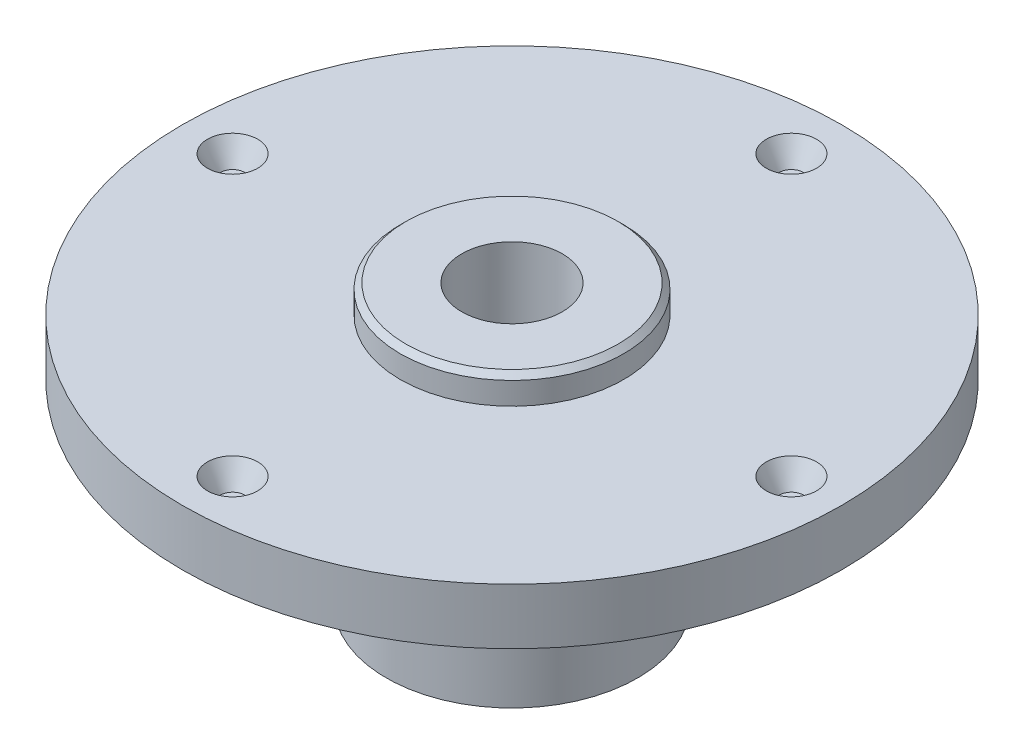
ISO-10303-21;
HEADER;
FILE_DESCRIPTION(('STEP AP214'),'2;1');
FILE_NAME('part.step','',(''),(''),'','','');
FILE_SCHEMA(('AUTOMOTIVE_DESIGN { 1 0 10303 214 1 1 1 1 }'));
ENDSEC;
DATA;
#1=APPLICATION_CONTEXT('core data for automotive mechanical design processes');
#2=APPLICATION_PROTOCOL_DEFINITION('international standard','automotive_design',2000,#1);
#3=PRODUCT_CONTEXT('',#1,'mechanical');
#4=PRODUCT('Part','Part','',(#3));
#5=PRODUCT_RELATED_PRODUCT_CATEGORY('part','',(#4));
#6=PRODUCT_DEFINITION_FORMATION('','',#4);
#7=PRODUCT_DEFINITION_CONTEXT('part definition',#1,'design');
#8=PRODUCT_DEFINITION('design','',#6,#7);
#9=PRODUCT_DEFINITION_SHAPE('','',#8);
#10=(LENGTH_UNIT() NAMED_UNIT(*) SI_UNIT(.MILLI.,.METRE.));
#11=(NAMED_UNIT(*) PLANE_ANGLE_UNIT() SI_UNIT($,.RADIAN.));
#12=(NAMED_UNIT(*) SI_UNIT($,.STERADIAN.) SOLID_ANGLE_UNIT());
#13=UNCERTAINTY_MEASURE_WITH_UNIT(LENGTH_MEASURE(1.E-05),#10,'distance_accuracy_value','');
#14=(GEOMETRIC_REPRESENTATION_CONTEXT(3) GLOBAL_UNCERTAINTY_ASSIGNED_CONTEXT((#13)) GLOBAL_UNIT_ASSIGNED_CONTEXT((#10,
#11,#12)) REPRESENTATION_CONTEXT('',''));
#15=CARTESIAN_POINT('',(0.,0.,0.));
#16=DIRECTION('',(0.,0.,1.));
#17=DIRECTION('',(1.,0.,0.));
#18=AXIS2_PLACEMENT_3D('',#15,#16,#17);
#19=CARTESIAN_POINT('',(0.,0.,0.));
#20=DIRECTION('',(0.,-1.,0.));
#21=DIRECTION('',(0.,0.,-1.));
#22=AXIS2_PLACEMENT_3D('',#19,#20,#21);
#23=CYLINDRICAL_SURFACE('',#22,9.);
#24=CARTESIAN_POINT('',(-8.64580823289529,15.,-2.5));
#25=CARTESIAN_POINT('',(-8.64581037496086,15.1374869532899,-2.49999714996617));
#26=CARTESIAN_POINT('',(-8.64912360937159,15.2750032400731,-2.48861977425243));
#27=CARTESIAN_POINT('',(-8.66197474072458,15.5460485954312,-2.44350693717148));
#28=CARTESIAN_POINT('',(-8.67151541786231,15.6795758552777,-2.40976148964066));
#29=CARTESIAN_POINT('',(-8.69565935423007,15.9386823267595,-2.32112008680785));
#30=CARTESIAN_POINT('',(-8.71025507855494,16.0642730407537,-2.26625559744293));
#31=CARTESIAN_POINT('',(-8.74285475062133,16.3044909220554,-2.13703377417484));
#32=CARTESIAN_POINT('',(-8.76085904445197,16.4191169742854,-2.06267446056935));
#33=CARTESIAN_POINT('',(-8.79879482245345,16.6372618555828,-1.89441531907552));
#34=CARTESIAN_POINT('',(-8.81876275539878,16.7404391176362,-1.80008077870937));
#35=CARTESIAN_POINT('',(-8.85806239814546,16.9297308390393,-1.59548286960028));
#36=CARTESIAN_POINT('',(-8.87739403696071,17.015843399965,-1.48521773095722));
#37=CARTESIAN_POINT('',(-8.91365202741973,17.1700044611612,-1.249500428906));
#38=CARTESIAN_POINT('',(-8.93053038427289,17.2377105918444,-1.12381632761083));
#39=CARTESIAN_POINT('',(-8.95956018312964,17.3508992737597,-0.862300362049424));
#40=CARTESIAN_POINT('',(-8.97171249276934,17.396385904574,-0.726470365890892));
#41=CARTESIAN_POINT('',(-8.98966318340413,17.4627309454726,-0.452086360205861));
#42=CARTESIAN_POINT('',(-8.99561138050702,17.4841710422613,-0.313682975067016));
#43=CARTESIAN_POINT('',(-9.00100867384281,17.503647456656,-0.0351244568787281));
#44=CARTESIAN_POINT('',(-9.00045894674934,17.5016880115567,0.105030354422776));
#45=CARTESIAN_POINT('',(-8.99303086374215,17.4748244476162,0.379054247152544));
#46=CARTESIAN_POINT('',(-8.9863259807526,17.4505492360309,0.512990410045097));
#47=CARTESIAN_POINT('',(-8.96754760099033,17.3807628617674,0.77480748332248));
#48=CARTESIAN_POINT('',(-8.95547378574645,17.3352504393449,0.902688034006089));
#49=CARTESIAN_POINT('',(-8.92706250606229,17.2238179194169,1.15033359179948));
#50=CARTESIAN_POINT('',(-8.91068150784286,17.1576880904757,1.26999902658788));
#51=CARTESIAN_POINT('',(-8.87541221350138,17.0070603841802,1.49674457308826));
#52=CARTESIAN_POINT('',(-8.85652339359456,16.922558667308,1.60382204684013));
#53=CARTESIAN_POINT('',(-8.81753663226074,16.7342713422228,1.8061067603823));
#54=CARTESIAN_POINT('',(-8.79741936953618,16.6299381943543,1.9008012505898));
#55=CARTESIAN_POINT('',(-8.75880383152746,16.4066673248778,2.07148108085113));
#56=CARTESIAN_POINT('',(-8.74030567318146,16.2877285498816,2.14746507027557));
#57=CARTESIAN_POINT('',(-8.70694013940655,16.0374352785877,2.27900238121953));
#58=CARTESIAN_POINT('',(-8.69209980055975,15.9059977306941,2.33440501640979));
#59=CARTESIAN_POINT('',(-8.66806022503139,15.6351564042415,2.42215297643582));
#60=CARTESIAN_POINT('',(-8.65885945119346,15.4957548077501,2.45450458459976));
#61=CARTESIAN_POINT('',(-8.64747148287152,15.2177654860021,2.49432455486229));
#62=CARTESIAN_POINT('',(-8.6450674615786,15.079296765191,2.50256249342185));
#63=CARTESIAN_POINT('',(-8.64694988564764,14.8029580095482,2.49605092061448));
#64=CARTESIAN_POINT('',(-8.65123554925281,14.6650879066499,2.48130409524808));
#65=CARTESIAN_POINT('',(-8.66580389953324,14.3969022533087,2.42992241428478));
#66=CARTESIAN_POINT('',(-8.6759568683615,14.2664883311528,2.39376059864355));
#67=CARTESIAN_POINT('',(-8.70098664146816,14.0135797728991,2.30111259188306));
#68=CARTESIAN_POINT('',(-8.71586410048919,13.8910862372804,2.24462358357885));
#69=CARTESIAN_POINT('',(-8.74910362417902,13.6543046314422,2.11139571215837));
#70=CARTESIAN_POINT('',(-8.767539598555,13.5402782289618,2.03421067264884));
#71=CARTESIAN_POINT('',(-8.80564999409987,13.3265137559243,1.86232721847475));
#72=CARTESIAN_POINT('',(-8.82532466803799,13.2267786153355,1.76762522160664));
#73=CARTESIAN_POINT('',(-8.86445019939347,13.0411785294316,1.55981743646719));
#74=CARTESIAN_POINT('',(-8.88387421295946,12.9558531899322,1.44622359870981));
#75=CARTESIAN_POINT('',(-8.91967402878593,12.8054760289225,1.20588311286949));
#76=CARTESIAN_POINT('',(-8.93604999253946,12.7404231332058,1.07913716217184));
#77=CARTESIAN_POINT('',(-8.96380327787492,12.6330504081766,0.816978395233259));
#78=CARTESIAN_POINT('',(-8.97521823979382,12.5905588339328,0.681640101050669));
#79=CARTESIAN_POINT('',(-8.99192942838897,12.5290318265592,0.405376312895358));
#80=CARTESIAN_POINT('',(-8.99722713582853,12.5099907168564,0.264452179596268));
#81=CARTESIAN_POINT('',(-9.00103042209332,12.4962856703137,-0.0139601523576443));
#82=CARTESIAN_POINT('',(-8.99975568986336,12.5008332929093,-0.151407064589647));
#83=CARTESIAN_POINT('',(-8.99106088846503,12.5323285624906,-0.423500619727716));
#84=CARTESIAN_POINT('',(-8.98364108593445,12.55927523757,-0.55814738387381));
#85=CARTESIAN_POINT('',(-8.96353984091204,12.6343432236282,-0.819784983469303));
#86=CARTESIAN_POINT('',(-8.95090116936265,12.6822925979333,-0.946828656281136));
#87=CARTESIAN_POINT('',(-8.9216782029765,12.7978519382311,-1.19113920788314));
#88=CARTESIAN_POINT('',(-8.90509332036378,12.8654648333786,-1.30840462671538));
#89=CARTESIAN_POINT('',(-8.86915397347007,13.0206719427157,-1.53345112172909));
#90=CARTESIAN_POINT('',(-8.84973411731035,13.1087800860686,-1.64086726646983));
#91=CARTESIAN_POINT('',(-8.81055920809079,13.3015179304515,-1.83965563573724));
#92=CARTESIAN_POINT('',(-8.79080406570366,13.4061520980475,-1.931023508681));
#93=CARTESIAN_POINT('',(-8.75263553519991,13.6320445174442,-2.09734241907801));
#94=CARTESIAN_POINT('',(-8.73426670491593,13.7536463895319,-2.17183796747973));
#95=CARTESIAN_POINT('',(-8.70160385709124,14.0081439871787,-2.29922652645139));
#96=CARTESIAN_POINT('',(-8.68730739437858,14.1410328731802,-2.35213250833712));
#97=CARTESIAN_POINT('',(-8.66621345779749,14.3943601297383,-2.42859494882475));
#98=CARTESIAN_POINT('',(-8.65862660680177,14.5137894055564,-2.45530563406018));
#99=CARTESIAN_POINT('',(-8.64842338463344,14.7554716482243,-2.49100820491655));
#100=CARTESIAN_POINT('',(-8.64580632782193,14.8777242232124,-2.50000253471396));
#101=CARTESIAN_POINT('',(-8.64580823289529,15.,-2.5));
#102=B_SPLINE_CURVE_WITH_KNOTS('',3,(#24,#25,#26,#27,#28,#29,#30,#31,#32,#33,#34,#35,#36,#37,
#38,#39,#40,#41,#42,#43,#44,#45,#46,#47,#48,#49,#50,#51,#52,#53,#54,#55,#56,#57,#58,#59,#60,#61,
#62,#63,#64,#65,#66,#67,#68,#69,#70,#71,#72,#73,#74,#75,#76,#77,#78,#79,#80,#81,#82,#83,#84,#85,
#86,#87,#88,#89,#90,#91,#92,#93,#94,#95,#96,#97,#98,#99,#100,#101),.UNSPECIFIED.,.T.,.F.,(4,2,2,
2,2,2,2,2,2,2,2,2,2,2,2,2,2,2,2,2,2,2,2,2,2,2,2,2,2,2,2,2,2,2,2,2,2,2,4),(0.,0.412010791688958,
0.824205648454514,1.23578872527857,1.64741361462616,2.0691389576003,2.49091119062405,
2.92006196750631,3.34913392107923,3.7675863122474,4.18596292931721,4.59289867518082,
4.99985856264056,5.4111013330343,5.82243013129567,6.24742875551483,6.67245804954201,
7.10054057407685,7.5285063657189,7.94265637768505,8.35675799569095,8.76203677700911,
9.16737174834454,9.58226667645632,9.99724654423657,10.4253750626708,10.8534808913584,
11.2782793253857,11.7029749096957,12.1135686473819,12.5241445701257,12.9314203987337,
13.3387569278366,13.7576868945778,14.1767302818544,14.6060087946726,15.0350290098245,
15.4015066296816,15.7679336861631),.UNSPECIFIED.);
#103=CARTESIAN_POINT('',(-8.64580823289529,15.,-2.5));
#104=VERTEX_POINT('',#103);
#105=EDGE_CURVE('E86',#104,#104,#102,.T.);
#106=ORIENTED_EDGE('',*,*,#105,.F.);
#107=EDGE_LOOP('',(#106));
#108=FACE_BOUND('',#107,.T.);
#109=CARTESIAN_POINT('',(8.64580823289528,15.,-2.5));
#110=CARTESIAN_POINT('',(8.64581037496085,14.8625130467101,-2.49999714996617));
#111=CARTESIAN_POINT('',(8.64912360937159,14.7249967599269,-2.48861977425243));
#112=CARTESIAN_POINT('',(8.66197474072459,14.4539514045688,-2.44350693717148));
#113=CARTESIAN_POINT('',(8.67151541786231,14.3204241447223,-2.40976148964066));
#114=CARTESIAN_POINT('',(8.69565935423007,14.0613176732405,-2.32112008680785));
#115=CARTESIAN_POINT('',(8.71025507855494,13.9357269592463,-2.26625559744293));
#116=CARTESIAN_POINT('',(8.74285475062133,13.6955090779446,-2.13703377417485));
#117=CARTESIAN_POINT('',(8.76085904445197,13.5808830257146,-2.06267446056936));
#118=CARTESIAN_POINT('',(8.79879482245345,13.3627381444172,-1.89441531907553));
#119=CARTESIAN_POINT('',(8.81876275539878,13.2595608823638,-1.80008077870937));
#120=CARTESIAN_POINT('',(8.85806239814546,13.0702691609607,-1.59548286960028));
#121=CARTESIAN_POINT('',(8.87739403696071,12.984156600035,-1.48521773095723));
#122=CARTESIAN_POINT('',(8.91365202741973,12.8299955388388,-1.249500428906));
#123=CARTESIAN_POINT('',(8.93053038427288,12.7622894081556,-1.12381632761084));
#124=CARTESIAN_POINT('',(8.95956018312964,12.6491007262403,-0.862300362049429));
#125=CARTESIAN_POINT('',(8.97171249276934,12.603614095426,-0.726470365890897));
#126=CARTESIAN_POINT('',(8.98966318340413,12.5372690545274,-0.452086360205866));
#127=CARTESIAN_POINT('',(8.99561138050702,12.5158289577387,-0.31368297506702));
#128=CARTESIAN_POINT('',(9.00100867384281,12.496352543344,-0.0351244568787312));
#129=CARTESIAN_POINT('',(9.00045894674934,12.4983119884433,0.105030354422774));
#130=CARTESIAN_POINT('',(8.99303086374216,12.5251755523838,0.379054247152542));
#131=CARTESIAN_POINT('',(8.9863259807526,12.5494507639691,0.512990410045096));
#132=CARTESIAN_POINT('',(8.96754760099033,12.6192371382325,0.774807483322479));
#133=CARTESIAN_POINT('',(8.95547378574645,12.6647495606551,0.902688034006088));
#134=CARTESIAN_POINT('',(8.92706250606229,12.7761820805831,1.15033359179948));
#135=CARTESIAN_POINT('',(8.91068150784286,12.8423119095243,1.26999902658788));
#136=CARTESIAN_POINT('',(8.87541221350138,12.9929396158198,1.49674457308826));
#137=CARTESIAN_POINT('',(8.85652339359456,13.077441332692,1.60382204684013));
#138=CARTESIAN_POINT('',(8.81753663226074,13.2657286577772,1.8061067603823));
#139=CARTESIAN_POINT('',(8.79741936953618,13.3700618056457,1.9008012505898));
#140=CARTESIAN_POINT('',(8.75880383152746,13.5933326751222,2.07148108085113));
#141=CARTESIAN_POINT('',(8.74030567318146,13.7122714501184,2.14746507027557));
#142=CARTESIAN_POINT('',(8.70694013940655,13.9625647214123,2.27900238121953));
#143=CARTESIAN_POINT('',(8.69209980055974,14.0940022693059,2.33440501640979));
#144=CARTESIAN_POINT('',(8.66806022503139,14.3648435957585,2.42215297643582));
#145=CARTESIAN_POINT('',(8.65885945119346,14.5042451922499,2.45450458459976));
#146=CARTESIAN_POINT('',(8.64747148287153,14.7822345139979,2.49432455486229));
#147=CARTESIAN_POINT('',(8.6450674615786,14.920703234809,2.50256249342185));
#148=CARTESIAN_POINT('',(8.64694988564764,15.1970419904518,2.49605092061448));
#149=CARTESIAN_POINT('',(8.65123554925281,15.3349120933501,2.48130409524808));
#150=CARTESIAN_POINT('',(8.66580389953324,15.6030977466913,2.42992241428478));
#151=CARTESIAN_POINT('',(8.6759568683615,15.7335116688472,2.39376059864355));
#152=CARTESIAN_POINT('',(8.70098664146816,15.9864202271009,2.30111259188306));
#153=CARTESIAN_POINT('',(8.71586410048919,16.1089137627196,2.24462358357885));
#154=CARTESIAN_POINT('',(8.74910362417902,16.3456953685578,2.11139571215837));
#155=CARTESIAN_POINT('',(8.76753959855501,16.4597217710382,2.03421067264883));
#156=CARTESIAN_POINT('',(8.80564999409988,16.6734862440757,1.86232721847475));
#157=CARTESIAN_POINT('',(8.82532466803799,16.7732213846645,1.76762522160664));
#158=CARTESIAN_POINT('',(8.86445019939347,16.9588214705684,1.5598174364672));
#159=CARTESIAN_POINT('',(8.88387421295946,17.0441468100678,1.44622359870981));
#160=CARTESIAN_POINT('',(8.91967402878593,17.1945239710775,1.20588311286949));
#161=CARTESIAN_POINT('',(8.93604999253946,17.2595768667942,1.07913716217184));
#162=CARTESIAN_POINT('',(8.96380327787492,17.3669495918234,0.816978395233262));
#163=CARTESIAN_POINT('',(8.97521823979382,17.4094411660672,0.681640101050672));
#164=CARTESIAN_POINT('',(8.99192942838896,17.4709681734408,0.405376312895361));
#165=CARTESIAN_POINT('',(8.99722713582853,17.4900092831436,0.26445217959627));
#166=CARTESIAN_POINT('',(9.00103042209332,17.5037143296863,-0.0139601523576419));
#167=CARTESIAN_POINT('',(8.99975568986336,17.4991667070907,-0.151407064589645));
#168=CARTESIAN_POINT('',(8.99106088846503,17.4676714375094,-0.423500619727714));
#169=CARTESIAN_POINT('',(8.98364108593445,17.44072476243,-0.558147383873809));
#170=CARTESIAN_POINT('',(8.96353984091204,17.3656567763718,-0.819784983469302));
#171=CARTESIAN_POINT('',(8.95090116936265,17.3177074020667,-0.946828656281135));
#172=CARTESIAN_POINT('',(8.9216782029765,17.2021480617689,-1.19113920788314));
#173=CARTESIAN_POINT('',(8.90509332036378,17.1345351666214,-1.30840462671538));
#174=CARTESIAN_POINT('',(8.86915397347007,16.9793280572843,-1.53345112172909));
#175=CARTESIAN_POINT('',(8.84973411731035,16.8912199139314,-1.64086726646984));
#176=CARTESIAN_POINT('',(8.81055920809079,16.6984820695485,-1.83965563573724));
#177=CARTESIAN_POINT('',(8.79080406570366,16.5938479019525,-1.931023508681));
#178=CARTESIAN_POINT('',(8.75263553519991,16.3679554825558,-2.09734241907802));
#179=CARTESIAN_POINT('',(8.73426670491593,16.2463536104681,-2.17183796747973));
#180=CARTESIAN_POINT('',(8.70160385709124,15.9918560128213,-2.29922652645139));
#181=CARTESIAN_POINT('',(8.68730739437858,15.8589671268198,-2.35213250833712));
#182=CARTESIAN_POINT('',(8.66621345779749,15.6056398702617,-2.42859494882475));
#183=CARTESIAN_POINT('',(8.65862660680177,15.4862105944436,-2.45530563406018));
#184=CARTESIAN_POINT('',(8.64842338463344,15.2445283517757,-2.49100820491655));
#185=CARTESIAN_POINT('',(8.64580632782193,15.1222757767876,-2.50000253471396));
#186=CARTESIAN_POINT('',(8.64580823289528,15.,-2.5));
#187=B_SPLINE_CURVE_WITH_KNOTS('',3,(#109,#110,#111,#112,#113,#114,#115,#116,#117,#118,#119,
#120,#121,#122,#123,#124,#125,#126,#127,#128,#129,#130,#131,#132,#133,#134,#135,#136,#137,#138,
#139,#140,#141,#142,#143,#144,#145,#146,#147,#148,#149,#150,#151,#152,#153,#154,#155,#156,#157,
#158,#159,#160,#161,#162,#163,#164,#165,#166,#167,#168,#169,#170,#171,#172,#173,#174,#175,#176,
#177,#178,#179,#180,#181,#182,#183,#184,#185,#186),.UNSPECIFIED.,.T.,.F.,(4,2,2,2,2,2,2,2,2,2,2,
2,2,2,2,2,2,2,2,2,2,2,2,2,2,2,2,2,2,2,2,2,2,2,2,2,2,2,4),(0.,0.412010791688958,
0.824205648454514,1.23578872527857,1.64741361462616,2.0691389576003,2.49091119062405,
2.9200619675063,3.34913392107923,3.7675863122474,4.18596292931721,4.59289867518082,
4.99985856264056,5.41110133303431,5.82243013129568,6.24742875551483,6.67245804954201,
7.10054057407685,7.52850636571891,7.94265637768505,8.35675799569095,8.76203677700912,
9.16737174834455,9.58226667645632,9.99724654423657,10.4253750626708,10.8534808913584,
11.2782793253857,11.7029749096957,12.1135686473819,12.5241445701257,12.9314203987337,
13.3387569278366,13.7576868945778,14.1767302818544,14.6060087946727,15.0350290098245,
15.4015066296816,15.7679336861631),.UNSPECIFIED.);
#188=CARTESIAN_POINT('',(8.64580823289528,15.,-2.5));
#189=VERTEX_POINT('',#188);
#190=EDGE_CURVE('E81',#189,#189,#187,.T.);
#191=ORIENTED_EDGE('',*,*,#190,.F.);
#192=EDGE_LOOP('',(#191));
#193=FACE_BOUND('',#192,.T.);
#194=CARTESIAN_POINT('',(0.,0.,0.));
#195=DIRECTION('',(0.,-1.,0.));
#196=DIRECTION('',(0.,0.,-1.));
#197=AXIS2_PLACEMENT_3D('',#194,#195,#196);
#198=CIRCLE('',#197,8.99999999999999);
#199=CARTESIAN_POINT('',(0.,0.,-8.99999999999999));
#200=VERTEX_POINT('',#199);
#201=EDGE_CURVE('E116',#200,#200,#198,.T.);
#202=ORIENTED_EDGE('',*,*,#201,.T.);
#203=EDGE_LOOP('',(#202));
#204=FACE_BOUND('',#203,.T.);
#205=CARTESIAN_POINT('',(0.,50.,0.));
#206=DIRECTION('',(0.,-1.,0.));
#207=DIRECTION('',(0.,0.,-1.));
#208=AXIS2_PLACEMENT_3D('',#205,#206,#207);
#209=CIRCLE('',#208,9.);
#210=CARTESIAN_POINT('',(0.,50.,-9.));
#211=VERTEX_POINT('',#210);
#212=EDGE_CURVE('E134',#211,#211,#209,.T.);
#213=ORIENTED_EDGE('',*,*,#212,.F.);
#214=EDGE_LOOP('',(#213));
#215=FACE_BOUND('',#214,.T.);
#216=ADVANCED_FACE('F34',(#108,#193,#204,#215),#23,.F.);
#217=CARTESIAN_POINT('',(20.,50.,0.));
#218=DIRECTION('',(0.,1.,0.));
#219=DIRECTION('',(0.,0.,1.));
#220=AXIS2_PLACEMENT_3D('',#217,#218,#219);
#221=PLANE('',#220);
#222=CARTESIAN_POINT('',(0.,50.,0.));
#223=DIRECTION('',(0.,1.,0.));
#224=DIRECTION('',(0.,0.,1.));
#225=AXIS2_PLACEMENT_3D('',#222,#223,#224);
#226=CIRCLE('',#225,19.);
#227=CARTESIAN_POINT('',(0.,50.,19.));
#228=VERTEX_POINT('',#227);
#229=EDGE_CURVE('E10',#228,#228,#226,.T.);
#230=ORIENTED_EDGE('',*,*,#229,.T.);
#231=EDGE_LOOP('',(#230));
#232=FACE_BOUND('',#231,.T.);
#233=ORIENTED_EDGE('',*,*,#212,.T.);
#234=EDGE_LOOP('',(#233));
#235=FACE_BOUND('',#234,.T.);
#236=ADVANCED_FACE('F158',(#232,#235),#221,.T.);
#237=CARTESIAN_POINT('',(0.,0.,0.));
#238=DIRECTION('',(0.,-1.,0.));
#239=DIRECTION('',(0.,0.,-1.));
#240=AXIS2_PLACEMENT_3D('',#237,#238,#239);
#241=CYLINDRICAL_SURFACE('',#240,20.);
#242=CARTESIAN_POINT('',(0.,49.,0.));
#243=DIRECTION('',(0.,1.,0.));
#244=DIRECTION('',(0.,0.,1.));
#245=AXIS2_PLACEMENT_3D('',#242,#243,#244);
#246=CIRCLE('',#245,20.);
#247=CARTESIAN_POINT('',(0.,49.,20.));
#248=VERTEX_POINT('',#247);
#249=EDGE_CURVE('E41',#248,#248,#246,.F.);
#250=ORIENTED_EDGE('',*,*,#249,.T.);
#251=EDGE_LOOP('',(#250));
#252=FACE_BOUND('',#251,.T.);
#253=CARTESIAN_POINT('',(0.,45.,0.));
#254=DIRECTION('',(0.,-1.,0.));
#255=DIRECTION('',(0.,0.,-1.));
#256=AXIS2_PLACEMENT_3D('',#253,#254,#255);
#257=CIRCLE('',#256,20.);
#258=CARTESIAN_POINT('',(0.,45.,-20.));
#259=VERTEX_POINT('',#258);
#260=EDGE_CURVE('E132',#259,#259,#257,.T.);
#261=ORIENTED_EDGE('',*,*,#260,.F.);
#262=EDGE_LOOP('',(#261));
#263=FACE_BOUND('',#262,.T.);
#264=ADVANCED_FACE('F163',(#252,#263),#241,.T.);
#265=CARTESIAN_POINT('',(59.,45.,0.));
#266=DIRECTION('',(0.,1.,0.));
#267=DIRECTION('',(0.,0.,1.));
#268=AXIS2_PLACEMENT_3D('',#265,#266,#267);
#269=PLANE('',#268);
#270=CARTESIAN_POINT('',(5.23722504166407E-13,45.,50.));
#271=DIRECTION('',(0.,1.,0.));
#272=DIRECTION('',(-1.,0.,0.));
#273=AXIS2_PLACEMENT_3D('',#270,#271,#272);
#274=CIRCLE('',#273,4.5);
#275=CARTESIAN_POINT('',(-4.49999999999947,45.,50.));
#276=VERTEX_POINT('',#275);
#277=EDGE_CURVE('E92',#276,#276,#274,.T.);
#278=ORIENTED_EDGE('',*,*,#277,.F.);
#279=EDGE_LOOP('',(#278));
#280=FACE_BOUND('',#279,.T.);
#281=CARTESIAN_POINT('',(-50.,45.,3.49148336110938E-13));
#282=DIRECTION('',(0.,1.,0.));
#283=DIRECTION('',(0.,0.,-1.));
#284=AXIS2_PLACEMENT_3D('',#281,#282,#283);
#285=CIRCLE('',#284,4.5);
#286=CARTESIAN_POINT('',(-50.,45.,-4.49999999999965));
#287=VERTEX_POINT('',#286);
#288=EDGE_CURVE('E98',#287,#287,#285,.T.);
#289=ORIENTED_EDGE('',*,*,#288,.F.);
#290=EDGE_LOOP('',(#289));
#291=FACE_BOUND('',#290,.T.);
#292=CARTESIAN_POINT('',(-1.74574168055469E-13,45.,-50.));
#293=DIRECTION('',(0.,1.,0.));
#294=DIRECTION('',(1.,0.,0.));
#295=AXIS2_PLACEMENT_3D('',#292,#293,#294);
#296=CIRCLE('',#295,4.5);
#297=CARTESIAN_POINT('',(4.49999999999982,45.,-50.));
#298=VERTEX_POINT('',#297);
#299=EDGE_CURVE('E104',#298,#298,#296,.T.);
#300=ORIENTED_EDGE('',*,*,#299,.F.);
#301=EDGE_LOOP('',(#300));
#302=FACE_BOUND('',#301,.T.);
#303=CARTESIAN_POINT('',(50.,45.,0.));
#304=DIRECTION('',(0.,1.,0.));
#305=DIRECTION('',(0.,0.,1.));
#306=AXIS2_PLACEMENT_3D('',#303,#304,#305);
#307=CIRCLE('',#306,4.5);
#308=CARTESIAN_POINT('',(50.,45.,4.5));
#309=VERTEX_POINT('',#308);
#310=EDGE_CURVE('E110',#309,#309,#307,.T.);
#311=ORIENTED_EDGE('',*,*,#310,.F.);
#312=EDGE_LOOP('',(#311));
#313=FACE_BOUND('',#312,.T.);
#314=ORIENTED_EDGE('',*,*,#260,.T.);
#315=EDGE_LOOP('',(#314));
#316=FACE_BOUND('',#315,.T.);
#317=CARTESIAN_POINT('',(0.,45.,0.));
#318=DIRECTION('',(0.,-1.,0.));
#319=DIRECTION('',(0.,0.,-1.));
#320=AXIS2_PLACEMENT_3D('',#317,#318,#319);
#321=CIRCLE('',#320,59.);
#322=CARTESIAN_POINT('',(0.,45.,-59.));
#323=VERTEX_POINT('',#322);
#324=EDGE_CURVE('E129',#323,#323,#321,.T.);
#325=ORIENTED_EDGE('',*,*,#324,.F.);
#326=EDGE_LOOP('',(#325));
#327=FACE_BOUND('',#326,.T.);
#328=ADVANCED_FACE('F188',(#280,#291,#302,#313,#316,#327),#269,.T.);
#329=CARTESIAN_POINT('',(0.,0.,0.));
#330=DIRECTION('',(0.,-1.,0.));
#331=DIRECTION('',(0.,0.,-1.));
#332=AXIS2_PLACEMENT_3D('',#329,#330,#331);
#333=CYLINDRICAL_SURFACE('',#332,59.);
#334=ORIENTED_EDGE('',*,*,#324,.T.);
#335=EDGE_LOOP('',(#334));
#336=FACE_BOUND('',#335,.T.);
#337=CARTESIAN_POINT('',(0.,35.,0.));
#338=DIRECTION('',(0.,-1.,0.));
#339=DIRECTION('',(0.,0.,-1.));
#340=AXIS2_PLACEMENT_3D('',#337,#338,#339);
#341=CIRCLE('',#340,59.);
#342=CARTESIAN_POINT('',(0.,35.,-59.));
#343=VERTEX_POINT('',#342);
#344=EDGE_CURVE('E125',#343,#343,#341,.T.);
#345=ORIENTED_EDGE('',*,*,#344,.F.);
#346=EDGE_LOOP('',(#345));
#347=FACE_BOUND('',#346,.T.);
#348=ADVANCED_FACE('F291',(#336,#347),#333,.T.);
#349=CARTESIAN_POINT('',(22.5,35.,0.));
#350=DIRECTION('',(0.,-1.,0.));
#351=DIRECTION('',(0.,0.,-1.));
#352=AXIS2_PLACEMENT_3D('',#349,#350,#351);
#353=PLANE('',#352);
#354=ORIENTED_EDGE('',*,*,#344,.T.);
#355=EDGE_LOOP('',(#354));
#356=FACE_BOUND('',#355,.T.);
#357=CARTESIAN_POINT('',(0.,35.,0.));
#358=DIRECTION('',(0.,-1.,0.));
#359=DIRECTION('',(0.,0.,-1.));
#360=AXIS2_PLACEMENT_3D('',#357,#358,#359);
#361=CIRCLE('',#360,22.5);
#362=CARTESIAN_POINT('',(0.,35.,-22.5));
#363=VERTEX_POINT('',#362);
#364=EDGE_CURVE('E122',#363,#363,#361,.T.);
#365=ORIENTED_EDGE('',*,*,#364,.F.);
#366=EDGE_LOOP('',(#365));
#367=FACE_BOUND('',#366,.T.);
#368=ADVANCED_FACE('F145',(#356,#367),#353,.T.);
#369=CARTESIAN_POINT('',(0.,0.,0.));
#370=DIRECTION('',(0.,-1.,0.));
#371=DIRECTION('',(0.,0.,-1.));
#372=AXIS2_PLACEMENT_3D('',#369,#370,#371);
#373=CYLINDRICAL_SURFACE('',#372,22.5);
#374=CARTESIAN_POINT('',(-22.5,12.5,0.));
#375=CARTESIAN_POINT('',(-22.4999982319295,12.5000060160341,0.139963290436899));
#376=CARTESIAN_POINT('',(-22.498680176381,12.5117934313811,0.280017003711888));
#377=CARTESIAN_POINT('',(-22.4935489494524,12.5586344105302,0.556235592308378));
#378=CARTESIAN_POINT('',(-22.4897330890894,12.5937130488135,0.692396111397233));
#379=CARTESIAN_POINT('',(-22.4800366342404,12.6860974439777,0.956788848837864));
#380=CARTESIAN_POINT('',(-22.4741573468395,12.7433891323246,1.08502602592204));
#381=CARTESIAN_POINT('',(-22.4609899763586,12.8785445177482,1.33003816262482));
#382=CARTESIAN_POINT('',(-22.4537021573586,12.9564043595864,1.44681526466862));
#383=CARTESIAN_POINT('',(-22.438497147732,13.1308525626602,1.66613219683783));
#384=CARTESIAN_POINT('',(-22.4305776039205,13.227513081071,1.76861447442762));
#385=CARTESIAN_POINT('',(-22.4150209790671,13.4366643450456,1.95593754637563));
#386=CARTESIAN_POINT('',(-22.4073839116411,13.5491558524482,2.04077749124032));
#387=CARTESIAN_POINT('',(-22.3932333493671,13.7871424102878,2.19061627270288));
#388=CARTESIAN_POINT('',(-22.3867228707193,13.9126709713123,2.25556219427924));
#389=CARTESIAN_POINT('',(-22.3755927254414,14.1729368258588,2.36343147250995));
#390=CARTESIAN_POINT('',(-22.37097300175,14.307673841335,2.4063554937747));
#391=CARTESIAN_POINT('',(-22.3641693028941,14.5819399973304,2.46878993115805));
#392=CARTESIAN_POINT('',(-22.3619753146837,14.7214469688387,2.48839662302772));
#393=CARTESIAN_POINT('',(-22.3602406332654,15.0017873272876,2.50393757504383));
#394=CARTESIAN_POINT('',(-22.3606998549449,15.1426206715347,2.49987259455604));
#395=CARTESIAN_POINT('',(-22.3642105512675,15.4209493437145,2.46826480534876));
#396=CARTESIAN_POINT('',(-22.3672503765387,15.5584568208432,2.44082750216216));
#397=CARTESIAN_POINT('',(-22.3755615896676,15.8269032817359,2.36341826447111));
#398=CARTESIAN_POINT('',(-22.3808330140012,15.9578421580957,2.3134459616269));
#399=CARTESIAN_POINT('',(-22.3930268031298,16.2097655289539,2.19227007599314));
#400=CARTESIAN_POINT('',(-22.3999527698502,16.3307275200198,2.1210200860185));
#401=CARTESIAN_POINT('',(-22.4146723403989,16.5590170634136,1.95934463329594));
#402=CARTESIAN_POINT('',(-22.4224659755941,16.6663441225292,1.86891847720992));
#403=CARTESIAN_POINT('',(-22.4380946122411,16.8649299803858,1.67087018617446));
#404=CARTESIAN_POINT('',(-22.4459296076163,16.9560980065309,1.56315700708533));
#405=CARTESIAN_POINT('',(-22.4607182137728,17.1190729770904,1.33390727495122));
#406=CARTESIAN_POINT('',(-22.4676718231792,17.1908798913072,1.21237070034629));
#407=CARTESIAN_POINT('',(-22.479917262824,17.313092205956,0.95885829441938));
#408=CARTESIAN_POINT('',(-22.4852087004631,17.3634925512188,0.826880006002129));
#409=CARTESIAN_POINT('',(-22.4935298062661,17.4413922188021,0.5562621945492));
#410=CARTESIAN_POINT('',(-22.4965595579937,17.4688923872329,0.417622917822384));
#411=CARTESIAN_POINT('',(-22.5000051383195,17.5000948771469,0.138404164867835));
#412=CARTESIAN_POINT('',(-22.5004347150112,17.5039223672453,-0.00216116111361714));
#413=CARTESIAN_POINT('',(-22.4986685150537,17.4880002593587,-0.281931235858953));
#414=CARTESIAN_POINT('',(-22.4964727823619,17.4682510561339,-0.421136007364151));
#415=CARTESIAN_POINT('',(-22.4897113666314,17.4058400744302,-0.693868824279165));
#416=CARTESIAN_POINT('',(-22.4851517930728,17.3632373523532,-0.827410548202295));
#417=CARTESIAN_POINT('',(-22.4741737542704,17.2563896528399,-1.08545283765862));
#418=CARTESIAN_POINT('',(-22.4677552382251,17.1921440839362,-1.20995315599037));
#419=CARTESIAN_POINT('',(-22.4537419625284,17.0435271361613,-1.44694158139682));
#420=CARTESIAN_POINT('',(-22.4461424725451,16.9590740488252,-1.55937816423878));
#421=CARTESIAN_POINT('',(-22.4306339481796,16.772555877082,-1.76852479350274));
#422=CARTESIAN_POINT('',(-22.4227249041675,16.6704902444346,-1.86523435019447));
#423=CARTESIAN_POINT('',(-22.407446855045,16.4510958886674,-2.0406202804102));
#424=CARTESIAN_POINT('',(-22.4000804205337,16.3337010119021,-2.11921415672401));
#425=CARTESIAN_POINT('',(-22.3867621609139,16.0873046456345,-2.2555694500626));
#426=CARTESIAN_POINT('',(-22.3808103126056,15.9583033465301,-2.31333120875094));
#427=CARTESIAN_POINT('',(-22.3710118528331,15.6926319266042,-2.40624640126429));
#428=CARTESIAN_POINT('',(-22.3671607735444,15.5559787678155,-2.4414478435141));
#429=CARTESIAN_POINT('',(-22.361986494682,15.278656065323,-2.48839847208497));
#430=CARTESIAN_POINT('',(-22.3606632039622,15.1379866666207,-2.50014850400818));
#431=CARTESIAN_POINT('',(-22.3606965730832,14.8574448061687,-2.49984946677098));
#432=CARTESIAN_POINT('',(-22.3620386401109,14.7175721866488,-2.48792998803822));
#433=CARTESIAN_POINT('',(-22.3672202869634,14.441830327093,-2.440903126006));
#434=CARTESIAN_POINT('',(-22.3710598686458,14.3059610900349,-2.40579572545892));
#435=CARTESIAN_POINT('',(-22.3807996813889,14.0420906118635,-2.31342739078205));
#436=CARTESIAN_POINT('',(-22.3866994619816,13.9140876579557,-2.25617129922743));
#437=CARTESIAN_POINT('',(-22.3998957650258,13.6694868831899,-2.12114385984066));
#438=CARTESIAN_POINT('',(-22.4071922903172,13.5528890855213,-2.04337247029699));
#439=CARTESIAN_POINT('',(-22.4224078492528,13.333744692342,-1.86903744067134));
#440=CARTESIAN_POINT('',(-22.4303299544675,13.2312752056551,-1.77237713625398));
#441=CARTESIAN_POINT('',(-22.4458763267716,13.0439576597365,-1.56320524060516));
#442=CARTESIAN_POINT('',(-22.45350052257,12.959113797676,-1.45068988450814));
#443=CARTESIAN_POINT('',(-22.4676169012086,12.8092445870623,-1.21261810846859));
#444=CARTESIAN_POINT('',(-22.4741055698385,12.7442803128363,-1.08702305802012));
#445=CARTESIAN_POINT('',(-22.4851829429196,12.636453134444,-0.826710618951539));
#446=CARTESIAN_POINT('',(-22.4897737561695,12.5935656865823,-0.692003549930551));
#447=CARTESIAN_POINT('',(-22.4954040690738,12.5416260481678,-0.463800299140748));
#448=CARTESIAN_POINT('',(-22.4971193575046,12.526038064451,-0.371755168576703));
#449=CARTESIAN_POINT('',(-22.499417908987,12.50522306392,-0.186486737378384));
#450=CARTESIAN_POINT('',(-22.50000117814,12.4999959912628,-0.0932634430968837));
#451=CARTESIAN_POINT('',(-22.5,12.5,0.));
#452=B_SPLINE_CURVE_WITH_KNOTS('',3,(#374,#375,#376,#377,#378,#379,#380,#381,#382,#383,#384,
#385,#386,#387,#388,#389,#390,#391,#392,#393,#394,#395,#396,#397,#398,#399,#400,#401,#402,#403,
#404,#405,#406,#407,#408,#409,#410,#411,#412,#413,#414,#415,#416,#417,#418,#419,#420,#421,#422,
#423,#424,#425,#426,#427,#428,#429,#430,#431,#432,#433,#434,#435,#436,#437,#438,#439,#440,#441,
#442,#443,#444,#445,#446,#447,#448,#449,#450,#451),.UNSPECIFIED.,.T.,.F.,(4,2,2,2,2,2,2,2,2,2,2,
2,2,2,2,2,2,2,2,2,2,2,2,2,2,2,2,2,2,2,2,2,2,2,2,2,2,2,4),(0.,0.419549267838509,
0.839550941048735,1.25928704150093,1.67894452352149,2.10024562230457,2.5215670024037,
2.94399949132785,3.36641923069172,3.78708870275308,4.20774468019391,4.62651176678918,
5.04528569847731,5.46497974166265,5.88468896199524,6.30668590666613,6.728683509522,
7.15078071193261,7.57286231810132,7.99271025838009,8.4125511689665,8.83131234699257,
9.25008497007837,9.67058038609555,10.0910888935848,10.5134761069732,10.9358563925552,
11.3573348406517,11.7787980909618,12.1979601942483,12.6171226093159,13.0361934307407,
13.4552651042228,13.8765403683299,14.2979158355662,14.7205731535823,15.1427595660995,
15.4223244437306,15.7018878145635),.UNSPECIFIED.);
#453=CARTESIAN_POINT('',(-22.5,12.5,0.));
#454=VERTEX_POINT('',#453);
#455=EDGE_CURVE('E45',#454,#454,#452,.T.);
#456=ORIENTED_EDGE('',*,*,#455,.F.);
#457=EDGE_LOOP('',(#456));
#458=FACE_BOUND('',#457,.T.);
#459=CARTESIAN_POINT('',(22.3606797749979,15.,-2.5));
#460=CARTESIAN_POINT('',(22.3606815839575,15.1399602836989,-2.49999398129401));
#461=CARTESIAN_POINT('',(22.3620080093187,15.2800109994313,-2.48820705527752));
#462=CARTESIAN_POINT('',(22.3671691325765,15.5562233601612,-2.44136819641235));
#463=CARTESIAN_POINT('',(22.3710065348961,15.6923806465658,-2.40629117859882));
#464=CARTESIAN_POINT('',(22.3807497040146,15.9567665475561,-2.3139115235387));
#465=CARTESIAN_POINT('',(22.3866541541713,16.0850001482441,-2.25662303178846));
#466=CARTESIAN_POINT('',(22.3998645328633,16.3300062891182,-2.12147517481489));
#467=CARTESIAN_POINT('',(22.4071701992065,16.4467809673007,-2.04361965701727));
#468=CARTESIAN_POINT('',(22.4223962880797,16.6661006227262,-1.86917582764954));
#469=CARTESIAN_POINT('',(22.4303190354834,16.7685872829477,-1.77251439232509));
#470=CARTESIAN_POINT('',(22.4458655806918,16.9559188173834,-1.56335945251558));
#471=CARTESIAN_POINT('',(22.4534893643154,17.0407628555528,-1.45086519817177));
#472=CARTESIAN_POINT('',(22.4676023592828,17.1906059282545,-1.21287621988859));
#473=CARTESIAN_POINT('',(22.4740885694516,17.255552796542,-1.08734845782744));
#474=CARTESIAN_POINT('',(22.4851701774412,17.3634240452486,-0.827084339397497));
#475=CARTESIAN_POINT('',(22.4897656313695,17.4063490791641,-0.692348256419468));
#476=CARTESIAN_POINT('',(22.4965315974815,17.4687856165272,-0.418085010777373));
#477=CARTESIAN_POINT('',(22.498712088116,17.4883934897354,-0.278580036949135));
#478=CARTESIAN_POINT('',(22.500436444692,17.5039374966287,0.00175640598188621));
#479=CARTESIAN_POINT('',(22.4999803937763,17.4998743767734,0.142587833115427));
#480=CARTESIAN_POINT('',(22.4964911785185,17.4682695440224,0.420924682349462));
#481=CARTESIAN_POINT('',(22.4934693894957,17.4408314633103,0.55844203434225));
#482=CARTESIAN_POINT('',(22.4852011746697,17.3634172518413,0.826907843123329));
#483=CARTESIAN_POINT('',(22.4799547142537,17.3134407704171,0.957856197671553));
#484=CARTESIAN_POINT('',(22.4678072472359,17.1922562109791,1.20979109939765));
#485=CARTESIAN_POINT('',(22.4609027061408,17.1210026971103,1.33075561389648));
#486=CARTESIAN_POINT('',(22.4462128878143,16.9593197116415,1.55904871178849));
#487=CARTESIAN_POINT('',(22.438427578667,16.8688895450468,1.6663768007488));
#488=CARTESIAN_POINT('',(22.4227992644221,16.670838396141,1.86495816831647));
#489=CARTESIAN_POINT('',(22.4149561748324,16.56312719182,1.95612148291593));
#490=CARTESIAN_POINT('',(22.4001380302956,16.3338830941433,2.11908788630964));
#491=CARTESIAN_POINT('',(22.3931629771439,16.212350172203,2.19089093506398));
#492=CARTESIAN_POINT('',(22.3808703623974,15.9588387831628,2.31310046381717));
#493=CARTESIAN_POINT('',(22.3755532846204,15.8268572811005,2.36350069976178));
#494=CARTESIAN_POINT('',(22.3671884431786,15.5562324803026,2.44139916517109));
#495=CARTESIAN_POINT('',(22.3641405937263,15.417589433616,2.4688982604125));
#496=CARTESIAN_POINT('',(22.3606745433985,15.1383688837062,2.5000966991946));
#497=CARTESIAN_POINT('',(22.3602424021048,14.9978056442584,2.50392221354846));
#498=CARTESIAN_POINT('',(22.362019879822,14.7180402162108,2.48799689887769));
#499=CARTESIAN_POINT('',(22.3642294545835,14.5788380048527,2.46824646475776));
#500=CARTESIAN_POINT('',(22.3710287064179,14.3061181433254,2.40583573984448));
#501=CARTESIAN_POINT('',(22.3756121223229,14.1725865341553,2.36323570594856));
#502=CARTESIAN_POINT('',(22.3866375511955,13.9145632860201,2.25639676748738));
#503=CARTESIAN_POINT('',(22.3930796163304,13.790071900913,2.19215725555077));
#504=CARTESIAN_POINT('',(22.4071300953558,13.553089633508,2.04354926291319));
#505=CARTESIAN_POINT('',(22.4147432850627,13.4406512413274,1.95909753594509));
#506=CARTESIAN_POINT('',(22.4302628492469,13.2315003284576,1.77258101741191));
#507=CARTESIAN_POINT('',(22.4381692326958,13.1347882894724,1.67051568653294));
#508=CARTESIAN_POINT('',(22.4534267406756,12.9593968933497,1.45112026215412));
#509=CARTESIAN_POINT('',(22.4607752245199,12.8808000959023,1.333723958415));
#510=CARTESIAN_POINT('',(22.4740501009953,12.7444396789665,1.08732394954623));
#511=CARTESIAN_POINT('',(22.479976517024,12.686675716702,0.958320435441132));
#512=CARTESIAN_POINT('',(22.4897276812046,12.5937590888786,0.692650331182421));
#513=CARTESIAN_POINT('',(22.4935569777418,12.5585574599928,0.556001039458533));
#514=CARTESIAN_POINT('',(22.4987012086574,12.5116051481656,0.278686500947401));
#515=CARTESIAN_POINT('',(22.5000162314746,12.4998536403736,0.13802139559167));
#516=CARTESIAN_POINT('',(22.4999835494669,12.5001483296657,-0.142522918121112));
#517=CARTESIAN_POINT('',(22.4986501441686,12.5120667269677,-0.282402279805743));
#518=CARTESIAN_POINT('',(22.4934987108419,12.5590937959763,-0.558157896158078));
#519=CARTESIAN_POINT('',(22.4896806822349,12.5942024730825,-0.694034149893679));
#520=CARTESIAN_POINT('',(22.4799874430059,12.6865760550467,-0.957918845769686));
#521=CARTESIAN_POINT('',(22.4741126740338,12.7438362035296,-1.0859289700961));
#522=CARTESIAN_POINT('',(22.4609589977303,12.8788739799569,-1.33054239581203));
#523=CARTESIAN_POINT('',(22.4536800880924,12.9566516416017,-1.44714567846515));
#524=CARTESIAN_POINT('',(22.438485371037,13.1309936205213,-1.66628987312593));
#525=CARTESIAN_POINT('',(22.4305664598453,13.2276531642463,-1.76875481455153));
#526=CARTESIAN_POINT('',(22.415010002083,13.4368216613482,-1.95606354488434));
#527=CARTESIAN_POINT('',(22.4073725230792,13.549334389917,-2.04090312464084));
#528=CARTESIAN_POINT('',(22.3932185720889,13.7874039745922,-2.1907676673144));
#529=CARTESIAN_POINT('',(22.38670562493,13.9129999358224,-2.25573080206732));
#530=CARTESIAN_POINT('',(22.3755797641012,14.1733142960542,-2.36355559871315));
#531=CARTESIAN_POINT('',(22.3709647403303,14.3080223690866,-2.40644181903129));
#532=CARTESIAN_POINT('',(22.3653031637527,14.5362223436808,-2.45837803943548));
#533=CARTESIAN_POINT('',(22.3635777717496,14.6282629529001,-2.47396448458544));
#534=CARTESIAN_POINT('',(22.3612654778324,14.8135223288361,-2.49477744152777));
#535=CARTESIAN_POINT('',(22.3606785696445,14.9067410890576,-2.50000401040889));
#536=CARTESIAN_POINT('',(22.3606797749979,15.,-2.5));
#537=B_SPLINE_CURVE_WITH_KNOTS('',3,(#459,#460,#461,#462,#463,#464,#465,#466,#467,#468,#469,
#470,#471,#472,#473,#474,#475,#476,#477,#478,#479,#480,#481,#482,#483,#484,#485,#486,#487,#488,
#489,#490,#491,#492,#493,#494,#495,#496,#497,#498,#499,#500,#501,#502,#503,#504,#505,#506,#507,
#508,#509,#510,#511,#512,#513,#514,#515,#516,#517,#518,#519,#520,#521,#522,#523,#524,#525,#526,
#527,#528,#529,#530,#531,#532,#533,#534,#535,#536),.UNSPECIFIED.,.T.,.F.,(4,2,2,2,2,2,2,2,2,2,2,
2,2,2,2,2,2,2,2,2,2,2,2,2,2,2,2,2,2,2,2,2,2,2,2,2,2,2,4),(0.,0.419540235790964,
0.839533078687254,1.25925888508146,1.67890622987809,2.10021914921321,2.52155202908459,
2.94398028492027,3.36639600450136,3.7870597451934,4.20771022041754,4.62650540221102,
5.04530710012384,5.46500959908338,5.88472731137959,6.30671223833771,6.72869803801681,
7.15080686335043,7.57289973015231,7.99274105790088,8.41257535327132,8.83130790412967,
9.25005220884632,9.67055177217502,10.0910642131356,10.5134568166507,10.935842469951,
11.3573083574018,11.7787594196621,12.1979411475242,12.6171229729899,13.0362148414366,
13.4553073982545,13.8765708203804,14.297934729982,14.7205963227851,15.1427867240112,
15.4223380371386,15.7018878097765),.UNSPECIFIED.);
#538=CARTESIAN_POINT('',(22.3606797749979,15.,-2.5));
#539=VERTEX_POINT('',#538);
#540=EDGE_CURVE('E49',#539,#539,#537,.T.);
#541=ORIENTED_EDGE('',*,*,#540,.F.);
#542=EDGE_LOOP('',(#541));
#543=FACE_BOUND('',#542,.T.);
#544=ORIENTED_EDGE('',*,*,#364,.T.);
#545=EDGE_LOOP('',(#544));
#546=FACE_BOUND('',#545,.T.);
#547=CARTESIAN_POINT('',(0.,0.,0.));
#548=DIRECTION('',(0.,-1.,0.));
#549=DIRECTION('',(0.,0.,-1.));
#550=AXIS2_PLACEMENT_3D('',#547,#548,#549);
#551=CIRCLE('',#550,22.5);
#552=CARTESIAN_POINT('',(0.,0.,-22.5));
#553=VERTEX_POINT('',#552);
#554=EDGE_CURVE('E119',#553,#553,#551,.T.);
#555=ORIENTED_EDGE('',*,*,#554,.F.);
#556=EDGE_LOOP('',(#555));
#557=FACE_BOUND('',#556,.T.);
#558=ADVANCED_FACE('F61',(#458,#543,#546,#557),#373,.T.);
#559=CARTESIAN_POINT('',(8.99999999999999,0.,0.));
#560=DIRECTION('',(0.,-1.,0.));
#561=DIRECTION('',(0.,0.,-1.));
#562=AXIS2_PLACEMENT_3D('',#559,#560,#561);
#563=PLANE('',#562);
#564=ORIENTED_EDGE('',*,*,#554,.T.);
#565=EDGE_LOOP('',(#564));
#566=FACE_BOUND('',#565,.T.);
#567=ORIENTED_EDGE('',*,*,#201,.F.);
#568=EDGE_LOOP('',(#567));
#569=FACE_BOUND('',#568,.T.);
#570=ADVANCED_FACE('F144',(#566,#569),#563,.T.);
#571=CARTESIAN_POINT('',(50.,45.,0.));
#572=DIRECTION('',(0.,1.,0.));
#573=DIRECTION('',(0.,0.,1.));
#574=AXIS2_PLACEMENT_3D('',#571,#572,#573);
#575=CONICAL_SURFACE('',#574,4.5,0.5235987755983);
#576=CARTESIAN_POINT('',(50.,41.,0.));
#577=DIRECTION('',(0.,1.,0.));
#578=DIRECTION('',(0.,0.,1.));
#579=AXIS2_PLACEMENT_3D('',#576,#577,#578);
#580=CIRCLE('',#579,2.19059892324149);
#581=CARTESIAN_POINT('',(50.,41.,2.19059892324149));
#582=VERTEX_POINT('',#581);
#583=EDGE_CURVE('E113',#582,#582,#580,.T.);
#584=ORIENTED_EDGE('',*,*,#583,.F.);
#585=EDGE_LOOP('',(#584));
#586=FACE_BOUND('',#585,.T.);
#587=ORIENTED_EDGE('',*,*,#310,.T.);
#588=EDGE_LOOP('',(#587));
#589=FACE_BOUND('',#588,.T.);
#590=ADVANCED_FACE('F153',(#586,#589),#575,.F.);
#591=CARTESIAN_POINT('',(47.8094010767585,41.,0.));
#592=DIRECTION('',(0.,-1.,0.));
#593=DIRECTION('',(0.,0.,-1.));
#594=AXIS2_PLACEMENT_3D('',#591,#592,#593);
#595=PLANE('',#594);
#596=ORIENTED_EDGE('',*,*,#583,.T.);
#597=EDGE_LOOP('',(#596));
#598=FACE_BOUND('',#597,.T.);
#599=ADVANCED_FACE('F274',(#598),#595,.F.);
#600=CARTESIAN_POINT('',(-1.74574168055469E-13,45.,-50.));
#601=DIRECTION('',(0.,1.,0.));
#602=DIRECTION('',(1.,0.,0.));
#603=AXIS2_PLACEMENT_3D('',#600,#601,#602);
#604=CONICAL_SURFACE('',#603,4.5,0.5235987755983);
#605=CARTESIAN_POINT('',(-1.74574168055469E-13,41.,-50.));
#606=DIRECTION('',(0.,1.,0.));
#607=DIRECTION('',(1.,0.,0.));
#608=AXIS2_PLACEMENT_3D('',#605,#606,#607);
#609=CIRCLE('',#608,2.19059892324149);
#610=CARTESIAN_POINT('',(2.19059892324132,41.,-50.));
#611=VERTEX_POINT('',#610);
#612=EDGE_CURVE('E107',#611,#611,#609,.T.);
#613=ORIENTED_EDGE('',*,*,#612,.F.);
#614=EDGE_LOOP('',(#613));
#615=FACE_BOUND('',#614,.T.);
#616=ORIENTED_EDGE('',*,*,#299,.T.);
#617=EDGE_LOOP('',(#616));
#618=FACE_BOUND('',#617,.T.);
#619=ADVANCED_FACE('F254',(#615,#618),#604,.F.);
#620=CARTESIAN_POINT('',(-1.66925728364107E-13,41.,-47.8094010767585));
#621=DIRECTION('',(0.,-1.,0.));
#622=DIRECTION('',(-1.,0.,0.));
#623=AXIS2_PLACEMENT_3D('',#620,#621,#622);
#624=PLANE('',#623);
#625=ORIENTED_EDGE('',*,*,#612,.T.);
#626=EDGE_LOOP('',(#625));
#627=FACE_BOUND('',#626,.T.);
#628=ADVANCED_FACE('F262',(#627),#624,.F.);
#629=CARTESIAN_POINT('',(-50.,45.,3.49148336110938E-13));
#630=DIRECTION('',(0.,1.,0.));
#631=DIRECTION('',(0.,0.,-1.));
#632=AXIS2_PLACEMENT_3D('',#629,#630,#631);
#633=CONICAL_SURFACE('',#632,4.5,0.5235987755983);
#634=CARTESIAN_POINT('',(-50.,41.,3.49148336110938E-13));
#635=DIRECTION('',(0.,1.,0.));
#636=DIRECTION('',(0.,0.,-1.));
#637=AXIS2_PLACEMENT_3D('',#634,#635,#636);
#638=CIRCLE('',#637,2.19059892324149);
#639=CARTESIAN_POINT('',(-50.,41.,-2.19059892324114));
#640=VERTEX_POINT('',#639);
#641=EDGE_CURVE('E101',#640,#640,#638,.T.);
#642=ORIENTED_EDGE('',*,*,#641,.F.);
#643=EDGE_LOOP('',(#642));
#644=FACE_BOUND('',#643,.T.);
#645=ORIENTED_EDGE('',*,*,#288,.T.);
#646=EDGE_LOOP('',(#645));
#647=FACE_BOUND('',#646,.T.);
#648=ADVANCED_FACE('F235',(#644,#647),#633,.F.);
#649=CARTESIAN_POINT('',(-47.8094010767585,41.,3.33851456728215E-13));
#650=DIRECTION('',(0.,-1.,0.));
#651=DIRECTION('',(0.,0.,1.));
#652=AXIS2_PLACEMENT_3D('',#649,#650,#651);
#653=PLANE('',#652);
#654=ORIENTED_EDGE('',*,*,#641,.T.);
#655=EDGE_LOOP('',(#654));
#656=FACE_BOUND('',#655,.T.);
#657=ADVANCED_FACE('F243',(#656),#653,.F.);
#658=CARTESIAN_POINT('',(5.23722504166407E-13,45.,50.));
#659=DIRECTION('',(0.,1.,0.));
#660=DIRECTION('',(-1.,0.,0.));
#661=AXIS2_PLACEMENT_3D('',#658,#659,#660);
#662=CONICAL_SURFACE('',#661,4.5,0.5235987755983);
#663=CARTESIAN_POINT('',(5.23722504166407E-13,41.,50.));
#664=DIRECTION('',(0.,1.,0.));
#665=DIRECTION('',(-1.,0.,0.));
#666=AXIS2_PLACEMENT_3D('',#663,#664,#665);
#667=CIRCLE('',#666,2.19059892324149);
#668=CARTESIAN_POINT('',(-2.19059892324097,41.,50.));
#669=VERTEX_POINT('',#668);
#670=EDGE_CURVE('E95',#669,#669,#667,.T.);
#671=ORIENTED_EDGE('',*,*,#670,.F.);
#672=EDGE_LOOP('',(#671));
#673=FACE_BOUND('',#672,.T.);
#674=ORIENTED_EDGE('',*,*,#277,.T.);
#675=EDGE_LOOP('',(#674));
#676=FACE_BOUND('',#675,.T.);
#677=ADVANCED_FACE('F73',(#673,#676),#662,.F.);
#678=CARTESIAN_POINT('',(5.00777185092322E-13,41.,47.8094010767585));
#679=DIRECTION('',(0.,-1.,0.));
#680=DIRECTION('',(1.,0.,0.));
#681=AXIS2_PLACEMENT_3D('',#678,#679,#680);
#682=PLANE('',#681);
#683=ORIENTED_EDGE('',*,*,#670,.T.);
#684=EDGE_LOOP('',(#683));
#685=FACE_BOUND('',#684,.T.);
#686=ADVANCED_FACE('F71',(#685),#682,.F.);
#687=CARTESIAN_POINT('',(-22.5,15.,0.));
#688=DIRECTION('',(1.,0.,0.));
#689=DIRECTION('',(0.,0.,-1.));
#690=AXIS2_PLACEMENT_3D('',#687,#688,#689);
#691=CYLINDRICAL_SURFACE('',#690,2.5);
#692=ORIENTED_EDGE('',*,*,#190,.T.);
#693=EDGE_LOOP('',(#692));
#694=FACE_BOUND('',#693,.T.);
#695=ORIENTED_EDGE('',*,*,#540,.T.);
#696=EDGE_LOOP('',(#695));
#697=FACE_BOUND('',#696,.T.);
#698=ADVANCED_FACE('F65',(#694,#697),#691,.F.);
#699=ORIENTED_EDGE('',*,*,#105,.T.);
#700=EDGE_LOOP('',(#699));
#701=FACE_BOUND('',#700,.T.);
#702=ORIENTED_EDGE('',*,*,#455,.T.);
#703=EDGE_LOOP('',(#702));
#704=FACE_BOUND('',#703,.T.);
#705=ADVANCED_FACE('F70',(#701,#704),#691,.F.);
#706=CARTESIAN_POINT('',(0.,49.,0.));
#707=DIRECTION('',(0.,-1.,0.));
#708=DIRECTION('',(0.,0.,-1.));
#709=AXIS2_PLACEMENT_3D('',#706,#707,#708);
#710=CONICAL_SURFACE('',#709,20.,0.785398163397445);
#711=ORIENTED_EDGE('',*,*,#229,.F.);
#712=EDGE_LOOP('',(#711));
#713=FACE_BOUND('',#712,.T.);
#714=ORIENTED_EDGE('',*,*,#249,.F.);
#715=EDGE_LOOP('',(#714));
#716=FACE_BOUND('',#715,.T.);
#717=ADVANCED_FACE('F74',(#713,#716),#710,.T.);
#718=CLOSED_SHELL('',(#216,#236,#264,#328,#348,#368,#558,#570,#590,#599,#619,#628,#648,#657,
#677,#686,#698,#705,#717));
#719=MANIFOLD_SOLID_BREP('B2',#718);
#720=ADVANCED_BREP_SHAPE_REPRESENTATION('',(#18,#719),#14);
#721=SHAPE_DEFINITION_REPRESENTATION(#9,#720);
ENDSEC;
END-ISO-10303-21;
